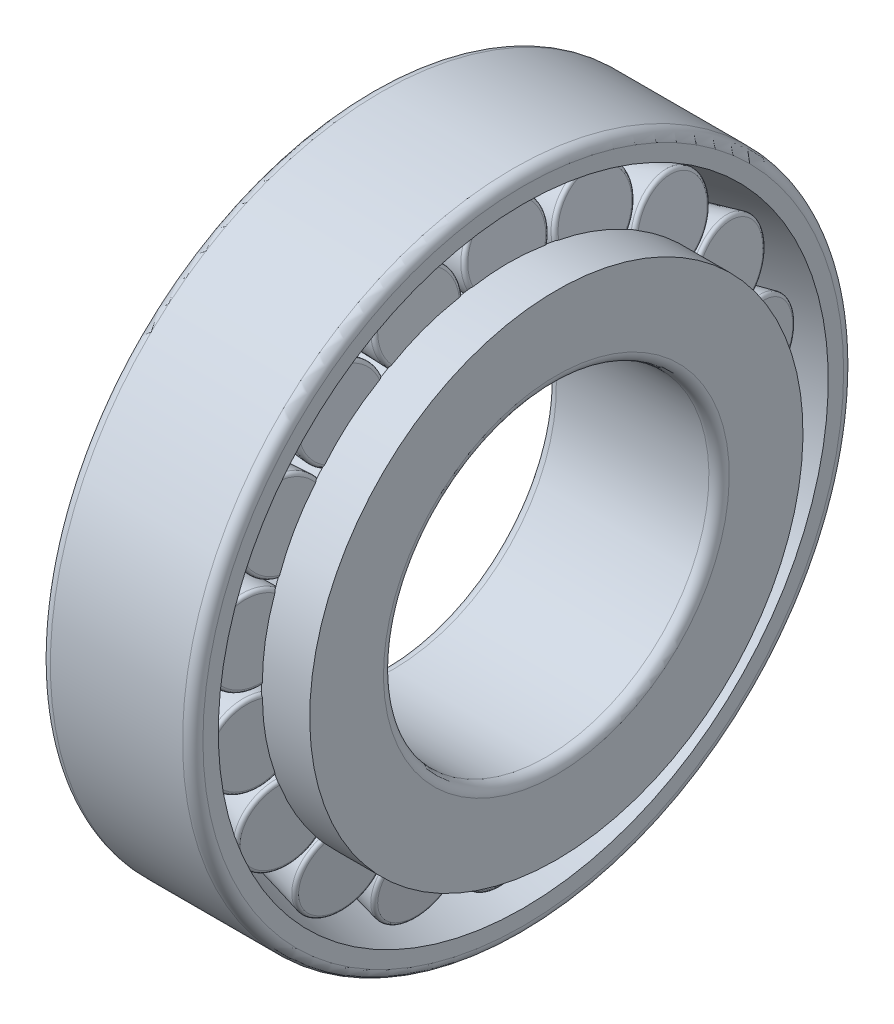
from build123d import *

# Parameters (mm, degrees)
CIRCULAR_PATTERN1_COUNT = 18


with BuildPart() as part:
    # Sketch1 → Revolve1 (revolve)
    with BuildSketch(Plane.XY, mode=Mode.PRIVATE) as revolve1_sk:
        with BuildLine():
            Line((-4.340078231, 20.512372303), (-4.577654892, 22.012372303))
            Line((-4.577654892, 22.012372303), (-6.247, 22.012372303))
            Line((-6.247, 22.012372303), (-6.247, 17))
            ThreePointArc((-6.247, 17), (-5.954106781, 16.292893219), (-5.247, 16))
            Line((-5.247, 16), (9.753, 16))
            ThreePointArc((9.753, 16), (10.460106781, 16.292893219), (10.753, 17))
            Line((10.753, 17), (10.753, 24.25))
            Line((10.753, 24.25), (6.028075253, 24.25))
            Line((6.028075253, 24.25), (6.5, 21.270384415))
            Line((6.5, 21.270384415), (-4.340078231, 20.512372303))
        make_face()
    revolve(revolve1_sk.sketch.rotate(Axis((10.753, 0, 0), (1, 0, 0)), 180), axis=Axis((10.753, 0, 0), (1, 0, 0)))

    # Sketch2 → Revolve2 (revolve)
    with BuildSketch(Plane.XY, mode=Mode.PRIVATE) as revolve2_sk:
        with BuildLine():
            Line((-4.856967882, 23.648036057), (5.874461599, 25.347727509))
            Line((5.874461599, 25.347727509), (6.466831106, 21.607653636))
            ThreePointArc((6.466831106, 21.607653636), (6.399154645, 21.350600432), (6.16391359, 21.226834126))
            Line((6.16391359, 21.226834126), (-4.0553124, 20.512236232))
            ThreePointArc((-4.0553124, 20.512236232), (-4.283761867, 20.583171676), (-4.404269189, 20.789808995))
            Line((-4.404269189, 20.789808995), (-4.856967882, 23.648036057))
        make_face()
    revolve2 = revolve(revolve2_sk.sketch.rotate(Axis((-4.856967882, 23.648036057, 0), (0.9876883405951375, 0.15643446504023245, 0)), 5.181962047), axis=Axis((-4.856967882, 23.648036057, 0), (0.9876883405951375, 0.15643446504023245, 0)))

    # Sketch3 → Revolve3 (revolve)
    with BuildSketch(Plane.XY, mode=Mode.PRIVATE) as revolve3_sk:
        with BuildLine():
            Line((-7.5, 26.25), (7.5, 29.989920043))
            Line((7.5, 29.989920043), (7.5, 31.5))
            ThreePointArc((7.5, 31.5), (7.207106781, 32.207106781), (6.5, 32.5))
            Line((6.5, 32.5), (-6.5, 32.5))
            ThreePointArc((-6.5, 32.5), (-7.207106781, 32.207106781), (-7.5, 31.5))
            Line((-7.5, 31.5), (-7.5, 26.25))
        make_face()
    revolve(revolve3_sk.sketch.rotate(Axis((10.753, 0, 0), (1, 0, 0)), 180), axis=Axis((10.753, 0, 0), (1, 0, 0)))

    # Circular-Pattern1: Revolve2 ×18 about axis
    circular_pattern1_axis = Axis((0, 0, 0), (1, 0, 0))
    for i in range(1, CIRCULAR_PATTERN1_COUNT):
        add(revolve2.rotate(circular_pattern1_axis, i * 360 / CIRCULAR_PATTERN1_COUNT))


solid = part.part
